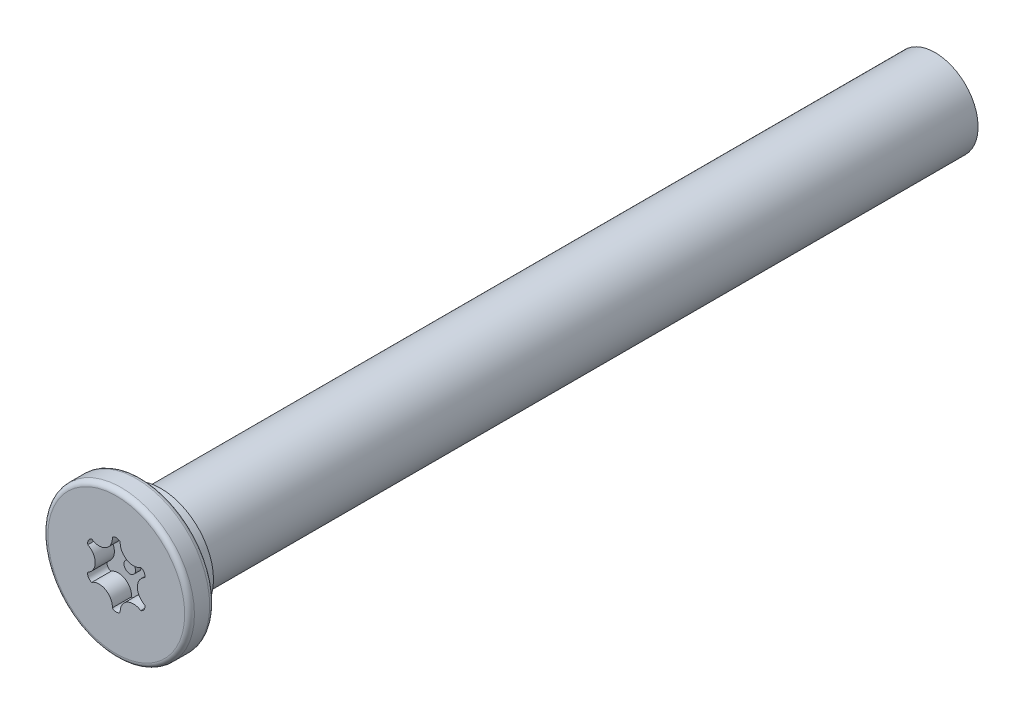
ISO-10303-21;
HEADER;
FILE_DESCRIPTION(('STEP AP214'),'2;1');
FILE_NAME('part.step','',(''),(''),'','','');
FILE_SCHEMA(('AUTOMOTIVE_DESIGN { 1 0 10303 214 1 1 1 1 }'));
ENDSEC;
DATA;
#1=APPLICATION_CONTEXT('core data for automotive mechanical design processes');
#2=APPLICATION_PROTOCOL_DEFINITION('international standard','automotive_design',2000,#1);
#3=PRODUCT_CONTEXT('',#1,'mechanical');
#4=PRODUCT('Part','Part','',(#3));
#5=PRODUCT_RELATED_PRODUCT_CATEGORY('part','',(#4));
#6=PRODUCT_DEFINITION_FORMATION('','',#4);
#7=PRODUCT_DEFINITION_CONTEXT('part definition',#1,'design');
#8=PRODUCT_DEFINITION('design','',#6,#7);
#9=PRODUCT_DEFINITION_SHAPE('','',#8);
#10=(LENGTH_UNIT() NAMED_UNIT(*) SI_UNIT(.MILLI.,.METRE.));
#11=(NAMED_UNIT(*) PLANE_ANGLE_UNIT() SI_UNIT($,.RADIAN.));
#12=(NAMED_UNIT(*) SI_UNIT($,.STERADIAN.) SOLID_ANGLE_UNIT());
#13=UNCERTAINTY_MEASURE_WITH_UNIT(LENGTH_MEASURE(1.E-05),#10,'distance_accuracy_value','');
#14=(GEOMETRIC_REPRESENTATION_CONTEXT(3) GLOBAL_UNCERTAINTY_ASSIGNED_CONTEXT((#13)) GLOBAL_UNIT_ASSIGNED_CONTEXT((#10,
#11,#12)) REPRESENTATION_CONTEXT('',''));
#15=CARTESIAN_POINT('',(0.,0.,0.));
#16=DIRECTION('',(0.,0.,1.));
#17=DIRECTION('',(1.,0.,0.));
#18=AXIS2_PLACEMENT_3D('',#15,#16,#17);
#19=CARTESIAN_POINT('',(0.,0.,0.));
#20=DIRECTION('',(0.,0.,1.));
#21=DIRECTION('',(1.,0.,0.));
#22=AXIS2_PLACEMENT_3D('',#19,#20,#21);
#23=PLANE('',#22);
#24=CARTESIAN_POINT('',(0.,0.,0.));
#25=DIRECTION('',(0.,0.,1.));
#26=DIRECTION('',(1.,0.,0.));
#27=AXIS2_PLACEMENT_3D('',#24,#25,#26);
#28=CIRCLE('',#27,3.55599999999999);
#29=CARTESIAN_POINT('',(3.55599999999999,0.,0.));
#30=VERTEX_POINT('',#29);
#31=EDGE_CURVE('E54',#30,#30,#28,.T.);
#32=ORIENTED_EDGE('',*,*,#31,.T.);
#33=EDGE_LOOP('',(#32));
#34=FACE_BOUND('',#33,.T.);
#35=CARTESIAN_POINT('',(0.893828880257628,1.54815703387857,0.));
#36=DIRECTION('',(0.,0.,1.));
#37=DIRECTION('',(1.,0.,0.));
#38=AXIS2_PLACEMENT_3D('',#35,#36,#37);
#39=CIRCLE('',#38,0.69);
#40=CARTESIAN_POINT('',(0.205060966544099,1.58937306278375,0.));
#41=VERTEX_POINT('',#40);
#42=CARTESIAN_POINT('',(1.27390696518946,0.972274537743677,0.));
#43=VERTEX_POINT('',#42);
#44=EDGE_CURVE('E181',#41,#43,#39,.T.);
#45=ORIENTED_EDGE('',*,*,#44,.T.);
#46=CARTESIAN_POINT('',(1.19884944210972,0.692156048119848,0.));
#47=DIRECTION('',(0.,0.,1.));
#48=DIRECTION('',(1.,0.,0.));
#49=AXIS2_PLACEMENT_3D('',#46,#47,#48);
#50=CIRCLE('',#49,0.29);
#51=CARTESIAN_POINT('',(1.47896793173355,0.617098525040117,0.));
#52=VERTEX_POINT('',#51);
#53=EDGE_CURVE('E61',#43,#52,#50,.F.);
#54=ORIENTED_EDGE('',*,*,#53,.T.);
#55=CARTESIAN_POINT('',(1.78765776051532,0.,0.));
#56=DIRECTION('',(0.,0.,1.));
#57=DIRECTION('',(1.,0.,0.));
#58=AXIS2_PLACEMENT_3D('',#55,#56,#57);
#59=CIRCLE('',#58,0.69);
#60=CARTESIAN_POINT('',(1.47896793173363,-0.617098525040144,0.));
#61=VERTEX_POINT('',#60);
#62=EDGE_CURVE('E111',#52,#61,#59,.T.);
#63=ORIENTED_EDGE('',*,*,#62,.T.);
#64=CARTESIAN_POINT('',(1.1988494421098,-0.692156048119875,0.));
#65=DIRECTION('',(0.,0.,1.));
#66=DIRECTION('',(1.,0.,0.));
#67=AXIS2_PLACEMENT_3D('',#64,#65,#66);
#68=CIRCLE('',#67,0.29);
#69=CARTESIAN_POINT('',(1.27390696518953,-0.972274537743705,0.));
#70=VERTEX_POINT('',#69);
#71=EDGE_CURVE('E216',#61,#70,#68,.F.);
#72=ORIENTED_EDGE('',*,*,#71,.T.);
#73=CARTESIAN_POINT('',(0.893828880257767,-1.54815703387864,0.));
#74=DIRECTION('',(0.,0.,1.));
#75=DIRECTION('',(1.,0.,0.));
#76=AXIS2_PLACEMENT_3D('',#73,#74,#75);
#77=CIRCLE('',#76,0.69);
#78=CARTESIAN_POINT('',(0.205060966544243,-1.5893730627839,0.));
#79=VERTEX_POINT('',#78);
#80=EDGE_CURVE('E160',#70,#79,#77,.T.);
#81=ORIENTED_EDGE('',*,*,#80,.T.);
#82=CARTESIAN_POINT('',(1.43067375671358E-13,-1.3843120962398,0.));
#83=DIRECTION('',(0.,0.,1.));
#84=DIRECTION('',(1.,0.,0.));
#85=AXIS2_PLACEMENT_3D('',#82,#83,#84);
#86=CIRCLE('',#85,0.29);
#87=CARTESIAN_POINT('',(-0.205060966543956,-1.5893730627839,0.));
#88=VERTEX_POINT('',#87);
#89=EDGE_CURVE('E210',#79,#88,#86,.F.);
#90=ORIENTED_EDGE('',*,*,#89,.T.);
#91=CARTESIAN_POINT('',(-0.893828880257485,-1.54815703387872,0.));
#92=DIRECTION('',(0.,0.,1.));
#93=DIRECTION('',(1.,0.,0.));
#94=AXIS2_PLACEMENT_3D('',#91,#92,#93);
#95=CIRCLE('',#94,0.69);
#96=CARTESIAN_POINT('',(-1.27390696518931,-0.97227453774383,0.));
#97=VERTEX_POINT('',#96);
#98=EDGE_CURVE('E206',#88,#97,#95,.T.);
#99=ORIENTED_EDGE('',*,*,#98,.T.);
#100=CARTESIAN_POINT('',(-1.19884944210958,-0.69215604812,0.));
#101=DIRECTION('',(0.,0.,1.));
#102=DIRECTION('',(1.,0.,0.));
#103=AXIS2_PLACEMENT_3D('',#100,#101,#102);
#104=CIRCLE('',#103,0.29);
#105=CARTESIAN_POINT('',(-1.47896793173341,-0.617098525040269,0.));
#106=VERTEX_POINT('',#105);
#107=EDGE_CURVE('E202',#97,#106,#104,.F.);
#108=ORIENTED_EDGE('',*,*,#107,.T.);
#109=CARTESIAN_POINT('',(-1.78765776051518,-1.56674837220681E-13,0.));
#110=DIRECTION('',(0.,0.,1.));
#111=DIRECTION('',(1.,0.,0.));
#112=AXIS2_PLACEMENT_3D('',#109,#110,#111);
#113=CIRCLE('',#112,0.69);
#114=CARTESIAN_POINT('',(-1.47896793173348,0.617098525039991,0.));
#115=VERTEX_POINT('',#114);
#116=EDGE_CURVE('E198',#106,#115,#113,.T.);
#117=ORIENTED_EDGE('',*,*,#116,.T.);
#118=CARTESIAN_POINT('',(-1.19884944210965,0.692156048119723,0.));
#119=DIRECTION('',(0.,0.,1.));
#120=DIRECTION('',(1.,0.,0.));
#121=AXIS2_PLACEMENT_3D('',#118,#119,#120);
#122=CIRCLE('',#121,0.29);
#123=CARTESIAN_POINT('',(-1.27390696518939,0.972274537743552,0.));
#124=VERTEX_POINT('',#123);
#125=EDGE_CURVE('E194',#115,#124,#122,.F.);
#126=ORIENTED_EDGE('',*,*,#125,.T.);
#127=CARTESIAN_POINT('',(-0.893828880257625,1.54815703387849,0.));
#128=DIRECTION('',(0.,0.,1.));
#129=DIRECTION('',(1.,0.,0.));
#130=AXIS2_PLACEMENT_3D('',#127,#128,#129);
#131=CIRCLE('',#130,0.690000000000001);
#132=CARTESIAN_POINT('',(-0.205060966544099,1.58937306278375,0.));
#133=VERTEX_POINT('',#132);
#134=EDGE_CURVE('E190',#124,#133,#131,.T.);
#135=ORIENTED_EDGE('',*,*,#134,.T.);
#136=CARTESIAN_POINT('',(0.,1.38431209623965,0.));
#137=DIRECTION('',(0.,0.,1.));
#138=DIRECTION('',(1.,0.,0.));
#139=AXIS2_PLACEMENT_3D('',#136,#137,#138);
#140=CIRCLE('',#139,0.29);
#141=EDGE_CURVE('E186',#133,#41,#140,.F.);
#142=ORIENTED_EDGE('',*,*,#141,.T.);
#143=EDGE_LOOP('',(#45,#54,#63,#72,#81,#90,#99,#108,#117,#126,#135,#142));
#144=FACE_BOUND('',#143,.T.);
#145=ADVANCED_FACE('F45',(#34,#144),#23,.T.);
#146=CARTESIAN_POINT('',(0.,0.,-1.3));
#147=DIRECTION('',(0.,0.,1.));
#148=DIRECTION('',(1.,0.,0.));
#149=AXIS2_PLACEMENT_3D('',#146,#147,#148);
#150=PLANE('',#149);
#151=CARTESIAN_POINT('',(0.,0.,-1.3));
#152=DIRECTION('',(0.,0.,1.));
#153=DIRECTION('',(1.,0.,0.));
#154=AXIS2_PLACEMENT_3D('',#151,#152,#153);
#155=CIRCLE('',#154,2.738000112);
#156=CARTESIAN_POINT('',(2.738000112,0.,-1.3));
#157=VERTEX_POINT('',#156);
#158=EDGE_CURVE('E11',#157,#157,#155,.F.);
#159=ORIENTED_EDGE('',*,*,#158,.F.);
#160=EDGE_LOOP('',(#159));
#161=FACE_BOUND('',#160,.T.);
#162=CARTESIAN_POINT('',(0.,0.,-1.3));
#163=DIRECTION('',(0.,0.,1.));
#164=DIRECTION('',(1.,0.,0.));
#165=AXIS2_PLACEMENT_3D('',#162,#163,#164);
#166=CIRCLE('',#165,3.55599999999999);
#167=CARTESIAN_POINT('',(3.55599999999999,0.,-1.3));
#168=VERTEX_POINT('',#167);
#169=EDGE_CURVE('E260',#168,#168,#166,.F.);
#170=ORIENTED_EDGE('',*,*,#169,.T.);
#171=EDGE_LOOP('',(#170));
#172=FACE_BOUND('',#171,.T.);
#173=ADVANCED_FACE('F283',(#161,#172),#150,.F.);
#174=CARTESIAN_POINT('',(0.,0.,-1.3));
#175=DIRECTION('',(0.,0.,1.));
#176=DIRECTION('',(1.,0.,0.));
#177=AXIS2_PLACEMENT_3D('',#174,#175,#176);
#178=CYLINDRICAL_SURFACE('',#177,3.80999999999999);
#179=CARTESIAN_POINT('',(0.,0.,-1.046));
#180=DIRECTION('',(0.,0.,1.));
#181=DIRECTION('',(1.,0.,0.));
#182=AXIS2_PLACEMENT_3D('',#179,#180,#181);
#183=CIRCLE('',#182,3.80999999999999);
#184=CARTESIAN_POINT('',(3.80999999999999,0.,-1.046));
#185=VERTEX_POINT('',#184);
#186=EDGE_CURVE('E256',#185,#185,#183,.T.);
#187=ORIENTED_EDGE('',*,*,#186,.T.);
#188=EDGE_LOOP('',(#187));
#189=FACE_BOUND('',#188,.T.);
#190=CARTESIAN_POINT('',(0.,0.,-0.254));
#191=DIRECTION('',(0.,0.,1.));
#192=DIRECTION('',(1.,0.,0.));
#193=AXIS2_PLACEMENT_3D('',#190,#191,#192);
#194=CIRCLE('',#193,3.80999999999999);
#195=CARTESIAN_POINT('',(3.80999999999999,0.,-0.254));
#196=VERTEX_POINT('',#195);
#197=EDGE_CURVE('E225',#196,#196,#194,.F.);
#198=ORIENTED_EDGE('',*,*,#197,.T.);
#199=EDGE_LOOP('',(#198));
#200=FACE_BOUND('',#199,.T.);
#201=ADVANCED_FACE('F289',(#189,#200),#178,.T.);
#202=CARTESIAN_POINT('',(1.19884944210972,0.692156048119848,-1.));
#203=DIRECTION('',(0.,0.,1.));
#204=DIRECTION('',(1.,0.,0.));
#205=AXIS2_PLACEMENT_3D('',#202,#203,#204);
#206=CYLINDRICAL_SURFACE('',#205,0.29);
#207=ORIENTED_EDGE('',*,*,#53,.F.);
#208=DIRECTION('',(0.,0.,1.));
#209=VECTOR('',#208,1.);
#210=CARTESIAN_POINT('',(1.27390696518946,0.972274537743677,-1.));
#211=LINE('',#210,#209);
#212=CARTESIAN_POINT('',(1.27390696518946,0.972274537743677,-1.));
#213=VERTEX_POINT('',#212);
#214=EDGE_CURVE('E178',#213,#43,#211,.T.);
#215=ORIENTED_EDGE('',*,*,#214,.F.);
#216=CARTESIAN_POINT('',(1.19884944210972,0.692156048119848,-1.));
#217=DIRECTION('',(0.,0.,1.));
#218=DIRECTION('',(1.,0.,0.));
#219=AXIS2_PLACEMENT_3D('',#216,#217,#218);
#220=CIRCLE('',#219,0.29);
#221=CARTESIAN_POINT('',(1.47896793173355,0.617098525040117,-1.));
#222=VERTEX_POINT('',#221);
#223=EDGE_CURVE('E221',#213,#222,#220,.F.);
#224=ORIENTED_EDGE('',*,*,#223,.T.);
#225=DIRECTION('',(0.,0.,1.));
#226=VECTOR('',#225,1.);
#227=CARTESIAN_POINT('',(1.47896793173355,0.617098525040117,-1.));
#228=LINE('',#227,#226);
#229=EDGE_CURVE('E222',#222,#52,#228,.T.);
#230=ORIENTED_EDGE('',*,*,#229,.T.);
#231=EDGE_LOOP('',(#207,#215,#224,#230));
#232=FACE_BOUND('',#231,.T.);
#233=ADVANCED_FACE('F294',(#232),#206,.F.);
#234=CARTESIAN_POINT('',(1.78765776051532,0.,-1.));
#235=DIRECTION('',(0.,0.,1.));
#236=DIRECTION('',(1.,0.,0.));
#237=AXIS2_PLACEMENT_3D('',#234,#235,#236);
#238=CYLINDRICAL_SURFACE('',#237,0.69);
#239=ORIENTED_EDGE('',*,*,#62,.F.);
#240=ORIENTED_EDGE('',*,*,#229,.F.);
#241=CARTESIAN_POINT('',(1.78765776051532,0.,-1.));
#242=DIRECTION('',(0.,0.,1.));
#243=DIRECTION('',(1.,0.,0.));
#244=AXIS2_PLACEMENT_3D('',#241,#242,#243);
#245=CIRCLE('',#244,0.69);
#246=CARTESIAN_POINT('',(1.47896793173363,-0.617098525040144,-1.));
#247=VERTEX_POINT('',#246);
#248=EDGE_CURVE('E70',#222,#247,#245,.T.);
#249=ORIENTED_EDGE('',*,*,#248,.T.);
#250=DIRECTION('',(0.,0.,1.));
#251=VECTOR('',#250,1.);
#252=CARTESIAN_POINT('',(1.47896793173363,-0.617098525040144,-1.));
#253=LINE('',#252,#251);
#254=EDGE_CURVE('E151',#247,#61,#253,.T.);
#255=ORIENTED_EDGE('',*,*,#254,.T.);
#256=EDGE_LOOP('',(#239,#240,#249,#255));
#257=FACE_BOUND('',#256,.T.);
#258=ADVANCED_FACE('F301',(#257),#238,.T.);
#259=CARTESIAN_POINT('',(1.1988494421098,-0.692156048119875,-1.));
#260=DIRECTION('',(0.,0.,1.));
#261=DIRECTION('',(1.,0.,0.));
#262=AXIS2_PLACEMENT_3D('',#259,#260,#261);
#263=CYLINDRICAL_SURFACE('',#262,0.29);
#264=ORIENTED_EDGE('',*,*,#71,.F.);
#265=ORIENTED_EDGE('',*,*,#254,.F.);
#266=CARTESIAN_POINT('',(1.1988494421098,-0.692156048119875,-1.));
#267=DIRECTION('',(0.,0.,1.));
#268=DIRECTION('',(1.,0.,0.));
#269=AXIS2_PLACEMENT_3D('',#266,#267,#268);
#270=CIRCLE('',#269,0.29);
#271=CARTESIAN_POINT('',(1.27390696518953,-0.972274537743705,-1.));
#272=VERTEX_POINT('',#271);
#273=EDGE_CURVE('E145',#247,#272,#270,.F.);
#274=ORIENTED_EDGE('',*,*,#273,.T.);
#275=DIRECTION('',(0.,0.,1.));
#276=VECTOR('',#275,1.);
#277=CARTESIAN_POINT('',(1.27390696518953,-0.972274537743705,-1.));
#278=LINE('',#277,#276);
#279=EDGE_CURVE('E149',#272,#70,#278,.T.);
#280=ORIENTED_EDGE('',*,*,#279,.T.);
#281=EDGE_LOOP('',(#264,#265,#274,#280));
#282=FACE_BOUND('',#281,.T.);
#283=ADVANCED_FACE('F148',(#282),#263,.F.);
#284=CARTESIAN_POINT('',(0.893828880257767,-1.54815703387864,-1.));
#285=DIRECTION('',(0.,0.,1.));
#286=DIRECTION('',(1.,0.,0.));
#287=AXIS2_PLACEMENT_3D('',#284,#285,#286);
#288=CYLINDRICAL_SURFACE('',#287,0.69);
#289=ORIENTED_EDGE('',*,*,#80,.F.);
#290=ORIENTED_EDGE('',*,*,#279,.F.);
#291=CARTESIAN_POINT('',(0.893828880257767,-1.54815703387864,-1.));
#292=DIRECTION('',(0.,0.,1.));
#293=DIRECTION('',(1.,0.,0.));
#294=AXIS2_PLACEMENT_3D('',#291,#292,#293);
#295=CIRCLE('',#294,0.69);
#296=CARTESIAN_POINT('',(0.205060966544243,-1.5893730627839,-1.));
#297=VERTEX_POINT('',#296);
#298=EDGE_CURVE('E154',#272,#297,#295,.T.);
#299=ORIENTED_EDGE('',*,*,#298,.T.);
#300=DIRECTION('',(0.,0.,1.));
#301=VECTOR('',#300,1.);
#302=CARTESIAN_POINT('',(0.205060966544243,-1.5893730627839,-1.));
#303=LINE('',#302,#301);
#304=EDGE_CURVE('E163',#297,#79,#303,.T.);
#305=ORIENTED_EDGE('',*,*,#304,.T.);
#306=EDGE_LOOP('',(#289,#290,#299,#305));
#307=FACE_BOUND('',#306,.T.);
#308=ADVANCED_FACE('F157',(#307),#288,.T.);
#309=CARTESIAN_POINT('',(1.43067375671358E-13,-1.3843120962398,-1.));
#310=DIRECTION('',(0.,0.,1.));
#311=DIRECTION('',(1.,0.,0.));
#312=AXIS2_PLACEMENT_3D('',#309,#310,#311);
#313=CYLINDRICAL_SURFACE('',#312,0.29);
#314=ORIENTED_EDGE('',*,*,#89,.F.);
#315=ORIENTED_EDGE('',*,*,#304,.F.);
#316=CARTESIAN_POINT('',(1.43067375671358E-13,-1.3843120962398,-1.));
#317=DIRECTION('',(0.,0.,1.));
#318=DIRECTION('',(1.,0.,0.));
#319=AXIS2_PLACEMENT_3D('',#316,#317,#318);
#320=CIRCLE('',#319,0.29);
#321=CARTESIAN_POINT('',(-0.205060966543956,-1.5893730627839,-1.));
#322=VERTEX_POINT('',#321);
#323=EDGE_CURVE('E168',#297,#322,#320,.F.);
#324=ORIENTED_EDGE('',*,*,#323,.T.);
#325=DIRECTION('',(0.,0.,1.));
#326=VECTOR('',#325,1.);
#327=CARTESIAN_POINT('',(-0.205060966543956,-1.5893730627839,-1.));
#328=LINE('',#327,#326);
#329=EDGE_CURVE('E230',#322,#88,#328,.T.);
#330=ORIENTED_EDGE('',*,*,#329,.T.);
#331=EDGE_LOOP('',(#314,#315,#324,#330));
#332=FACE_BOUND('',#331,.T.);
#333=ADVANCED_FACE('F318',(#332),#313,.F.);
#334=CARTESIAN_POINT('',(-0.893828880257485,-1.54815703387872,-1.));
#335=DIRECTION('',(0.,0.,1.));
#336=DIRECTION('',(1.,0.,0.));
#337=AXIS2_PLACEMENT_3D('',#334,#335,#336);
#338=CYLINDRICAL_SURFACE('',#337,0.69);
#339=ORIENTED_EDGE('',*,*,#98,.F.);
#340=ORIENTED_EDGE('',*,*,#329,.F.);
#341=CARTESIAN_POINT('',(-0.893828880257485,-1.54815703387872,-1.));
#342=DIRECTION('',(0.,0.,1.));
#343=DIRECTION('',(1.,0.,0.));
#344=AXIS2_PLACEMENT_3D('',#341,#342,#343);
#345=CIRCLE('',#344,0.69);
#346=CARTESIAN_POINT('',(-1.27390696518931,-0.97227453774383,-1.));
#347=VERTEX_POINT('',#346);
#348=EDGE_CURVE('E172',#322,#347,#345,.T.);
#349=ORIENTED_EDGE('',*,*,#348,.T.);
#350=DIRECTION('',(0.,0.,1.));
#351=VECTOR('',#350,1.);
#352=CARTESIAN_POINT('',(-1.27390696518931,-0.97227453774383,-1.));
#353=LINE('',#352,#351);
#354=EDGE_CURVE('E233',#347,#97,#353,.T.);
#355=ORIENTED_EDGE('',*,*,#354,.T.);
#356=EDGE_LOOP('',(#339,#340,#349,#355));
#357=FACE_BOUND('',#356,.T.);
#358=ADVANCED_FACE('F321',(#357),#338,.T.);
#359=CARTESIAN_POINT('',(-1.19884944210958,-0.69215604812,-1.));
#360=DIRECTION('',(0.,0.,1.));
#361=DIRECTION('',(1.,0.,0.));
#362=AXIS2_PLACEMENT_3D('',#359,#360,#361);
#363=CYLINDRICAL_SURFACE('',#362,0.29);
#364=ORIENTED_EDGE('',*,*,#107,.F.);
#365=ORIENTED_EDGE('',*,*,#354,.F.);
#366=CARTESIAN_POINT('',(-1.19884944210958,-0.69215604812,-1.));
#367=DIRECTION('',(0.,0.,1.));
#368=DIRECTION('',(1.,0.,0.));
#369=AXIS2_PLACEMENT_3D('',#366,#367,#368);
#370=CIRCLE('',#369,0.29);
#371=CARTESIAN_POINT('',(-1.47896793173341,-0.617098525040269,-1.));
#372=VERTEX_POINT('',#371);
#373=EDGE_CURVE('E374',#347,#372,#370,.F.);
#374=ORIENTED_EDGE('',*,*,#373,.T.);
#375=DIRECTION('',(0.,0.,1.));
#376=VECTOR('',#375,1.);
#377=CARTESIAN_POINT('',(-1.47896793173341,-0.617098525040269,-1.));
#378=LINE('',#377,#376);
#379=EDGE_CURVE('E236',#372,#106,#378,.T.);
#380=ORIENTED_EDGE('',*,*,#379,.T.);
#381=EDGE_LOOP('',(#364,#365,#374,#380));
#382=FACE_BOUND('',#381,.T.);
#383=ADVANCED_FACE('F325',(#382),#363,.F.);
#384=CARTESIAN_POINT('',(-1.78765776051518,-1.56674837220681E-13,-1.));
#385=DIRECTION('',(0.,0.,1.));
#386=DIRECTION('',(1.,0.,0.));
#387=AXIS2_PLACEMENT_3D('',#384,#385,#386);
#388=CYLINDRICAL_SURFACE('',#387,0.69);
#389=ORIENTED_EDGE('',*,*,#116,.F.);
#390=ORIENTED_EDGE('',*,*,#379,.F.);
#391=CARTESIAN_POINT('',(-1.78765776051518,-1.56674837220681E-13,-1.));
#392=DIRECTION('',(0.,0.,1.));
#393=DIRECTION('',(1.,0.,0.));
#394=AXIS2_PLACEMENT_3D('',#391,#392,#393);
#395=CIRCLE('',#394,0.69);
#396=CARTESIAN_POINT('',(-1.47896793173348,0.617098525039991,-1.));
#397=VERTEX_POINT('',#396);
#398=EDGE_CURVE('E371',#372,#397,#395,.T.);
#399=ORIENTED_EDGE('',*,*,#398,.T.);
#400=DIRECTION('',(0.,0.,1.));
#401=VECTOR('',#400,1.);
#402=CARTESIAN_POINT('',(-1.47896793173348,0.617098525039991,-1.));
#403=LINE('',#402,#401);
#404=EDGE_CURVE('E239',#397,#115,#403,.T.);
#405=ORIENTED_EDGE('',*,*,#404,.T.);
#406=EDGE_LOOP('',(#389,#390,#399,#405));
#407=FACE_BOUND('',#406,.T.);
#408=ADVANCED_FACE('F329',(#407),#388,.T.);
#409=CARTESIAN_POINT('',(-1.19884944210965,0.692156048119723,-1.));
#410=DIRECTION('',(0.,0.,1.));
#411=DIRECTION('',(1.,0.,0.));
#412=AXIS2_PLACEMENT_3D('',#409,#410,#411);
#413=CYLINDRICAL_SURFACE('',#412,0.29);
#414=ORIENTED_EDGE('',*,*,#125,.F.);
#415=ORIENTED_EDGE('',*,*,#404,.F.);
#416=CARTESIAN_POINT('',(-1.19884944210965,0.692156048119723,-1.));
#417=DIRECTION('',(0.,0.,1.));
#418=DIRECTION('',(1.,0.,0.));
#419=AXIS2_PLACEMENT_3D('',#416,#417,#418);
#420=CIRCLE('',#419,0.29);
#421=CARTESIAN_POINT('',(-1.27390696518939,0.972274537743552,-1.));
#422=VERTEX_POINT('',#421);
#423=EDGE_CURVE('E364',#397,#422,#420,.F.);
#424=ORIENTED_EDGE('',*,*,#423,.T.);
#425=DIRECTION('',(0.,0.,1.));
#426=VECTOR('',#425,1.);
#427=CARTESIAN_POINT('',(-1.27390696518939,0.972274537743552,-1.));
#428=LINE('',#427,#426);
#429=EDGE_CURVE('E242',#422,#124,#428,.T.);
#430=ORIENTED_EDGE('',*,*,#429,.T.);
#431=EDGE_LOOP('',(#414,#415,#424,#430));
#432=FACE_BOUND('',#431,.T.);
#433=ADVANCED_FACE('F333',(#432),#413,.F.);
#434=CARTESIAN_POINT('',(-0.893828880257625,1.54815703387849,-1.));
#435=DIRECTION('',(0.,0.,1.));
#436=DIRECTION('',(1.,0.,0.));
#437=AXIS2_PLACEMENT_3D('',#434,#435,#436);
#438=CYLINDRICAL_SURFACE('',#437,0.690000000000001);
#439=ORIENTED_EDGE('',*,*,#134,.F.);
#440=ORIENTED_EDGE('',*,*,#429,.F.);
#441=CARTESIAN_POINT('',(-0.893828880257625,1.54815703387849,-1.));
#442=DIRECTION('',(0.,0.,1.));
#443=DIRECTION('',(1.,0.,0.));
#444=AXIS2_PLACEMENT_3D('',#441,#442,#443);
#445=CIRCLE('',#444,0.690000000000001);
#446=CARTESIAN_POINT('',(-0.205060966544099,1.58937306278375,-1.));
#447=VERTEX_POINT('',#446);
#448=EDGE_CURVE('E360',#422,#447,#445,.T.);
#449=ORIENTED_EDGE('',*,*,#448,.T.);
#450=DIRECTION('',(0.,0.,1.));
#451=VECTOR('',#450,1.);
#452=CARTESIAN_POINT('',(-0.205060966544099,1.58937306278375,-1.));
#453=LINE('',#452,#451);
#454=EDGE_CURVE('E245',#447,#133,#453,.T.);
#455=ORIENTED_EDGE('',*,*,#454,.T.);
#456=EDGE_LOOP('',(#439,#440,#449,#455));
#457=FACE_BOUND('',#456,.T.);
#458=ADVANCED_FACE('F337',(#457),#438,.T.);
#459=CARTESIAN_POINT('',(0.,1.38431209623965,-1.));
#460=DIRECTION('',(0.,0.,1.));
#461=DIRECTION('',(1.,0.,0.));
#462=AXIS2_PLACEMENT_3D('',#459,#460,#461);
#463=CYLINDRICAL_SURFACE('',#462,0.29);
#464=ORIENTED_EDGE('',*,*,#141,.F.);
#465=ORIENTED_EDGE('',*,*,#454,.F.);
#466=CARTESIAN_POINT('',(0.,1.38431209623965,-1.));
#467=DIRECTION('',(0.,0.,1.));
#468=DIRECTION('',(1.,0.,0.));
#469=AXIS2_PLACEMENT_3D('',#466,#467,#468);
#470=CIRCLE('',#469,0.29);
#471=CARTESIAN_POINT('',(0.205060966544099,1.58937306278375,-1.));
#472=VERTEX_POINT('',#471);
#473=EDGE_CURVE('E357',#447,#472,#470,.F.);
#474=ORIENTED_EDGE('',*,*,#473,.T.);
#475=DIRECTION('',(0.,0.,1.));
#476=VECTOR('',#475,1.);
#477=CARTESIAN_POINT('',(0.205060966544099,1.58937306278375,-1.));
#478=LINE('',#477,#476);
#479=EDGE_CURVE('E248',#472,#41,#478,.T.);
#480=ORIENTED_EDGE('',*,*,#479,.T.);
#481=EDGE_LOOP('',(#464,#465,#474,#480));
#482=FACE_BOUND('',#481,.T.);
#483=ADVANCED_FACE('F341',(#482),#463,.F.);
#484=CARTESIAN_POINT('',(0.893828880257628,1.54815703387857,-1.));
#485=DIRECTION('',(0.,0.,1.));
#486=DIRECTION('',(1.,0.,0.));
#487=AXIS2_PLACEMENT_3D('',#484,#485,#486);
#488=CYLINDRICAL_SURFACE('',#487,0.69);
#489=ORIENTED_EDGE('',*,*,#44,.F.);
#490=ORIENTED_EDGE('',*,*,#479,.F.);
#491=CARTESIAN_POINT('',(0.893828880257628,1.54815703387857,-1.));
#492=DIRECTION('',(0.,0.,1.));
#493=DIRECTION('',(1.,0.,0.));
#494=AXIS2_PLACEMENT_3D('',#491,#492,#493);
#495=CIRCLE('',#494,0.69);
#496=EDGE_CURVE('E118',#472,#213,#495,.T.);
#497=ORIENTED_EDGE('',*,*,#496,.T.);
#498=ORIENTED_EDGE('',*,*,#214,.T.);
#499=EDGE_LOOP('',(#489,#490,#497,#498));
#500=FACE_BOUND('',#499,.T.);
#501=ADVANCED_FACE('F344',(#500),#488,.T.);
#502=CARTESIAN_POINT('',(0.,0.,-1.));
#503=DIRECTION('',(0.,0.,1.));
#504=DIRECTION('',(1.,0.,0.));
#505=AXIS2_PLACEMENT_3D('',#502,#503,#504);
#506=PLANE('',#505);
#507=CARTESIAN_POINT('',(0.,0.,-1.));
#508=DIRECTION('',(0.,0.,1.));
#509=DIRECTION('',(1.,0.,0.));
#510=AXIS2_PLACEMENT_3D('',#507,#508,#509);
#511=CIRCLE('',#510,0.3);
#512=CARTESIAN_POINT('',(0.3,0.,-1.));
#513=VERTEX_POINT('',#512);
#514=EDGE_CURVE('E396',#513,#513,#511,.T.);
#515=ORIENTED_EDGE('',*,*,#514,.F.);
#516=EDGE_LOOP('',(#515));
#517=FACE_BOUND('',#516,.T.);
#518=ORIENTED_EDGE('',*,*,#223,.F.);
#519=ORIENTED_EDGE('',*,*,#496,.F.);
#520=ORIENTED_EDGE('',*,*,#473,.F.);
#521=ORIENTED_EDGE('',*,*,#448,.F.);
#522=ORIENTED_EDGE('',*,*,#423,.F.);
#523=ORIENTED_EDGE('',*,*,#398,.F.);
#524=ORIENTED_EDGE('',*,*,#373,.F.);
#525=ORIENTED_EDGE('',*,*,#348,.F.);
#526=ORIENTED_EDGE('',*,*,#323,.F.);
#527=ORIENTED_EDGE('',*,*,#298,.F.);
#528=ORIENTED_EDGE('',*,*,#273,.F.);
#529=ORIENTED_EDGE('',*,*,#248,.F.);
#530=EDGE_LOOP('',(#518,#519,#520,#521,#522,#523,#524,#525,#526,#527,#528,#529));
#531=FACE_BOUND('',#530,.T.);
#532=ADVANCED_FACE('F166',(#517,#531),#506,.T.);
#533=CARTESIAN_POINT('',(0.,0.,-1.046));
#534=DIRECTION('',(0.,0.,1.));
#535=DIRECTION('',(1.,0.,0.));
#536=AXIS2_PLACEMENT_3D('',#533,#534,#535);
#537=TOROIDAL_SURFACE('',#536,3.55599999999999,0.254);
#538=ORIENTED_EDGE('',*,*,#169,.F.);
#539=EDGE_LOOP('',(#538));
#540=FACE_BOUND('',#539,.T.);
#541=ORIENTED_EDGE('',*,*,#186,.F.);
#542=EDGE_LOOP('',(#541));
#543=FACE_BOUND('',#542,.T.);
#544=ADVANCED_FACE('F271',(#540,#543),#537,.T.);
#545=CARTESIAN_POINT('',(0.,0.,-0.254));
#546=DIRECTION('',(0.,0.,1.));
#547=DIRECTION('',(1.,0.,0.));
#548=AXIS2_PLACEMENT_3D('',#545,#546,#547);
#549=TOROIDAL_SURFACE('',#548,3.55599999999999,0.254);
#550=ORIENTED_EDGE('',*,*,#197,.F.);
#551=EDGE_LOOP('',(#550));
#552=FACE_BOUND('',#551,.T.);
#553=ORIENTED_EDGE('',*,*,#31,.F.);
#554=EDGE_LOOP('',(#553));
#555=FACE_BOUND('',#554,.T.);
#556=ADVANCED_FACE('F47',(#552,#555),#549,.T.);
#557=CARTESIAN_POINT('',(0.,0.,-2.316));
#558=DIRECTION('',(0.,0.,-1.));
#559=DIRECTION('',(-1.,0.,0.));
#560=AXIS2_PLACEMENT_3D('',#557,#558,#559);
#561=PLANE('',#560);
#562=CARTESIAN_POINT('',(0.,0.,-2.316));
#563=DIRECTION('',(0.,0.,-1.));
#564=DIRECTION('',(-1.,0.,0.));
#565=AXIS2_PLACEMENT_3D('',#562,#563,#564);
#566=CIRCLE('',#565,2.738000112);
#567=CARTESIAN_POINT('',(-2.738000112,0.,-2.316));
#568=VERTEX_POINT('',#567);
#569=EDGE_CURVE('E182',#568,#568,#566,.T.);
#570=ORIENTED_EDGE('',*,*,#569,.T.);
#571=EDGE_LOOP('',(#570));
#572=FACE_BOUND('',#571,.T.);
#573=CARTESIAN_POINT('',(0.,0.,-2.316));
#574=DIRECTION('',(0.,0.,-1.));
#575=DIRECTION('',(-1.,0.,0.));
#576=AXIS2_PLACEMENT_3D('',#573,#574,#575);
#577=CIRCLE('',#576,2.230000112);
#578=CARTESIAN_POINT('',(-2.230000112,0.,-2.316));
#579=VERTEX_POINT('',#578);
#580=EDGE_CURVE('E400',#579,#579,#577,.T.);
#581=ORIENTED_EDGE('',*,*,#580,.F.);
#582=EDGE_LOOP('',(#581));
#583=FACE_BOUND('',#582,.T.);
#584=ADVANCED_FACE('F270',(#572,#583),#561,.T.);
#585=CARTESIAN_POINT('',(0.,0.,-2.316));
#586=DIRECTION('',(0.,0.,1.));
#587=DIRECTION('',(1.,0.,0.));
#588=AXIS2_PLACEMENT_3D('',#585,#586,#587);
#589=CYLINDRICAL_SURFACE('',#588,2.738000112);
#590=ORIENTED_EDGE('',*,*,#569,.F.);
#591=EDGE_LOOP('',(#590));
#592=FACE_BOUND('',#591,.T.);
#593=ORIENTED_EDGE('',*,*,#158,.T.);
#594=EDGE_LOOP('',(#593));
#595=FACE_BOUND('',#594,.T.);
#596=ADVANCED_FACE('F277',(#592,#595),#589,.T.);
#597=CARTESIAN_POINT('',(0.,0.,-0.7));
#598=DIRECTION('',(0.,0.,-1.));
#599=DIRECTION('',(-1.,0.,0.));
#600=AXIS2_PLACEMENT_3D('',#597,#598,#599);
#601=CYLINDRICAL_SURFACE('',#600,0.3);
#602=CARTESIAN_POINT('',(0.,0.,-0.7));
#603=DIRECTION('',(0.,0.,1.));
#604=DIRECTION('',(1.,0.,0.));
#605=AXIS2_PLACEMENT_3D('',#602,#603,#604);
#606=CIRCLE('',#605,0.3);
#607=CARTESIAN_POINT('',(0.3,0.,-0.7));
#608=VERTEX_POINT('',#607);
#609=EDGE_CURVE('E395',#608,#608,#606,.T.);
#610=ORIENTED_EDGE('',*,*,#609,.F.);
#611=EDGE_LOOP('',(#610));
#612=FACE_BOUND('',#611,.T.);
#613=ORIENTED_EDGE('',*,*,#514,.T.);
#614=EDGE_LOOP('',(#613));
#615=FACE_BOUND('',#614,.T.);
#616=ADVANCED_FACE('F424',(#612,#615),#601,.T.);
#617=CARTESIAN_POINT('',(0.,0.,-0.7));
#618=DIRECTION('',(0.,0.,1.));
#619=DIRECTION('',(1.,0.,0.));
#620=AXIS2_PLACEMENT_3D('',#617,#618,#619);
#621=PLANE('',#620);
#622=ORIENTED_EDGE('',*,*,#609,.T.);
#623=EDGE_LOOP('',(#622));
#624=FACE_BOUND('',#623,.T.);
#625=ADVANCED_FACE('F416',(#624),#621,.T.);
#626=CARTESIAN_POINT('',(0.,0.,-42.575));
#627=DIRECTION('',(0.,0.,1.));
#628=DIRECTION('',(1.,0.,0.));
#629=AXIS2_PLACEMENT_3D('',#626,#627,#628);
#630=CYLINDRICAL_SURFACE('',#629,2.230000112);
#631=ORIENTED_EDGE('',*,*,#580,.T.);
#632=EDGE_LOOP('',(#631));
#633=FACE_BOUND('',#632,.T.);
#634=CARTESIAN_POINT('',(0.,0.,-42.575));
#635=DIRECTION('',(0.,0.,-1.));
#636=DIRECTION('',(-1.,0.,0.));
#637=AXIS2_PLACEMENT_3D('',#634,#635,#636);
#638=CIRCLE('',#637,2.230000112);
#639=CARTESIAN_POINT('',(-2.230000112,0.,-42.575));
#640=VERTEX_POINT('',#639);
#641=EDGE_CURVE('E407',#640,#640,#638,.T.);
#642=ORIENTED_EDGE('',*,*,#641,.F.);
#643=EDGE_LOOP('',(#642));
#644=FACE_BOUND('',#643,.T.);
#645=ADVANCED_FACE('F414',(#633,#644),#630,.T.);
#646=CARTESIAN_POINT('',(0.,0.,-42.575));
#647=DIRECTION('',(0.,0.,-1.));
#648=DIRECTION('',(-1.,0.,0.));
#649=AXIS2_PLACEMENT_3D('',#646,#647,#648);
#650=PLANE('',#649);
#651=ORIENTED_EDGE('',*,*,#641,.T.);
#652=EDGE_LOOP('',(#651));
#653=FACE_BOUND('',#652,.T.);
#654=ADVANCED_FACE('F412',(#653),#650,.T.);
#655=CLOSED_SHELL('',(#145,#173,#201,#233,#258,#283,#308,#333,#358,#383,#408,#433,#458,#483,
#501,#532,#544,#556,#584,#596,#616,#625,#645,#654));
#656=MANIFOLD_SOLID_BREP('B2',#655);
#657=ADVANCED_BREP_SHAPE_REPRESENTATION('',(#18,#656),#14);
#658=SHAPE_DEFINITION_REPRESENTATION(#9,#657);
ENDSEC;
END-ISO-10303-21;
